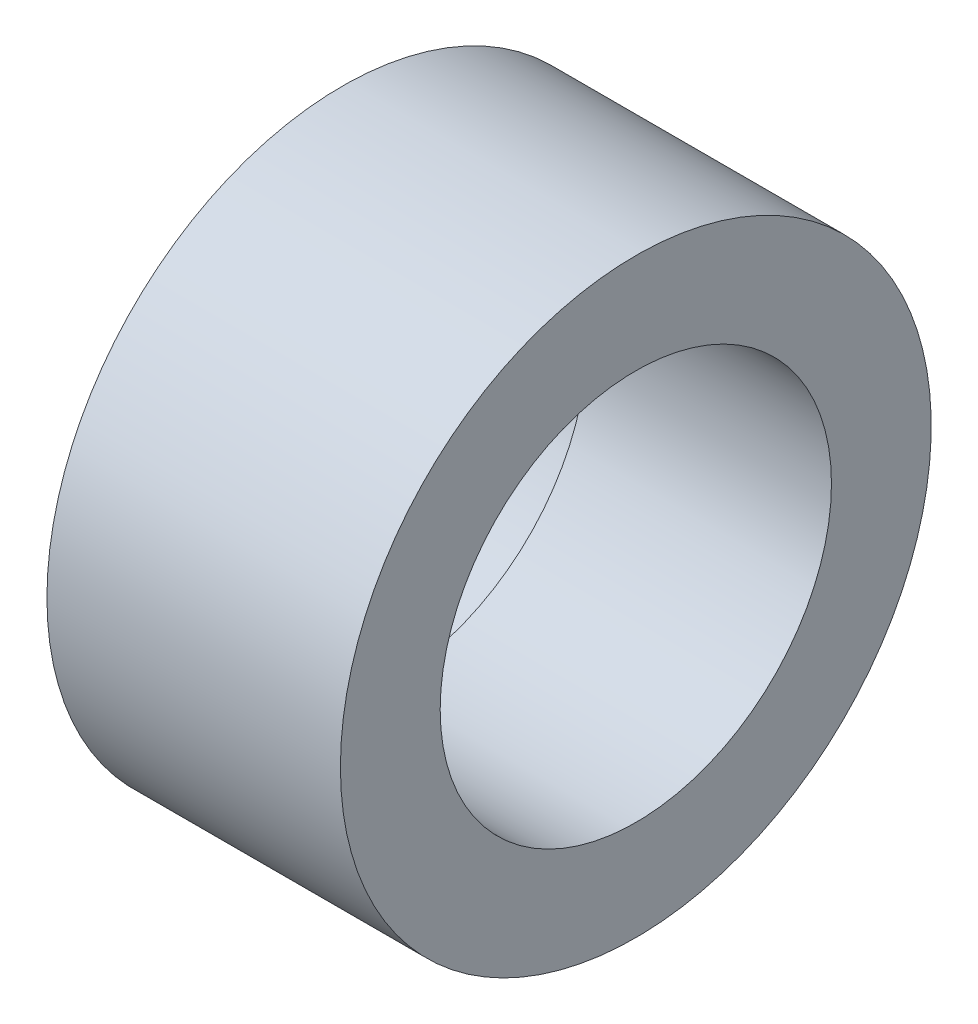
ISO-10303-21;
HEADER;
FILE_DESCRIPTION(('STEP AP214'),'2;1');
FILE_NAME('part.step','',(''),(''),'','','');
FILE_SCHEMA(('AUTOMOTIVE_DESIGN { 1 0 10303 214 1 1 1 1 }'));
ENDSEC;
DATA;
#1=APPLICATION_CONTEXT('core data for automotive mechanical design processes');
#2=APPLICATION_PROTOCOL_DEFINITION('international standard','automotive_design',2000,#1);
#3=PRODUCT_CONTEXT('',#1,'mechanical');
#4=PRODUCT('Part','Part','',(#3));
#5=PRODUCT_RELATED_PRODUCT_CATEGORY('part','',(#4));
#6=PRODUCT_DEFINITION_FORMATION('','',#4);
#7=PRODUCT_DEFINITION_CONTEXT('part definition',#1,'design');
#8=PRODUCT_DEFINITION('design','',#6,#7);
#9=PRODUCT_DEFINITION_SHAPE('','',#8);
#10=(LENGTH_UNIT() NAMED_UNIT(*) SI_UNIT(.MILLI.,.METRE.));
#11=(NAMED_UNIT(*) PLANE_ANGLE_UNIT() SI_UNIT($,.RADIAN.));
#12=(NAMED_UNIT(*) SI_UNIT($,.STERADIAN.) SOLID_ANGLE_UNIT());
#13=UNCERTAINTY_MEASURE_WITH_UNIT(LENGTH_MEASURE(1.E-05),#10,'distance_accuracy_value','');
#14=(GEOMETRIC_REPRESENTATION_CONTEXT(3) GLOBAL_UNCERTAINTY_ASSIGNED_CONTEXT((#13)) GLOBAL_UNIT_ASSIGNED_CONTEXT((#10,
#11,#12)) REPRESENTATION_CONTEXT('',''));
#15=CARTESIAN_POINT('',(0.,0.,0.));
#16=DIRECTION('',(0.,0.,1.));
#17=DIRECTION('',(1.,0.,0.));
#18=AXIS2_PLACEMENT_3D('',#15,#16,#17);
#19=CARTESIAN_POINT('',(19.05,0.,0.));
#20=DIRECTION('',(-1.,0.,0.));
#21=DIRECTION('',(0.,0.,1.));
#22=AXIS2_PLACEMENT_3D('',#19,#20,#21);
#23=CYLINDRICAL_SURFACE('',#22,12.7);
#24=CARTESIAN_POINT('',(19.05,0.,0.));
#25=DIRECTION('',(1.,0.,0.));
#26=DIRECTION('',(0.,0.,-1.));
#27=AXIS2_PLACEMENT_3D('',#24,#25,#26);
#28=CIRCLE('',#27,12.7);
#29=CARTESIAN_POINT('',(19.05,0.,12.7));
#30=VERTEX_POINT('',#29);
#31=EDGE_CURVE('E44',#30,#30,#28,.T.);
#32=CARTESIAN_POINT('',(3.175,0.,0.));
#33=DIRECTION('',(-1.,0.,0.));
#34=DIRECTION('',(0.,0.,1.));
#35=AXIS2_PLACEMENT_3D('',#32,#33,#34);
#36=CIRCLE('',#35,12.7);
#37=CARTESIAN_POINT('',(3.175,0.,12.7));
#38=VERTEX_POINT('',#37);
#39=EDGE_CURVE('E35',#38,#38,#36,.T.);
#40=CARTESIAN_POINT('',(19.05,0.,12.7));
#41=CARTESIAN_POINT('',(18.8846354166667,0.,12.7));
#42=CARTESIAN_POINT('',(18.7192708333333,0.,12.7));
#43=CARTESIAN_POINT('',(18.3885416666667,0.,12.7));
#44=CARTESIAN_POINT('',(18.2231770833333,0.,12.7));
#45=CARTESIAN_POINT('',(17.8924479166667,0.,12.7));
#46=CARTESIAN_POINT('',(17.7270833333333,0.,12.7));
#47=CARTESIAN_POINT('',(17.3963541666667,0.,12.7));
#48=CARTESIAN_POINT('',(17.2309895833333,0.,12.7));
#49=CARTESIAN_POINT('',(16.9002604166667,0.,12.7));
#50=CARTESIAN_POINT('',(16.7348958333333,0.,12.7));
#51=CARTESIAN_POINT('',(16.4041666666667,0.,12.7));
#52=CARTESIAN_POINT('',(16.2388020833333,0.,12.7));
#53=CARTESIAN_POINT('',(15.9080729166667,0.,12.7));
#54=CARTESIAN_POINT('',(15.7427083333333,0.,12.7));
#55=CARTESIAN_POINT('',(15.4119791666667,0.,12.7));
#56=CARTESIAN_POINT('',(15.2466145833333,0.,12.7));
#57=CARTESIAN_POINT('',(14.9158854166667,0.,12.7));
#58=CARTESIAN_POINT('',(14.7505208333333,0.,12.7));
#59=CARTESIAN_POINT('',(14.4197916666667,0.,12.7));
#60=CARTESIAN_POINT('',(14.2544270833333,0.,12.7));
#61=CARTESIAN_POINT('',(13.9236979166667,0.,12.7));
#62=CARTESIAN_POINT('',(13.7583333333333,0.,12.7));
#63=CARTESIAN_POINT('',(13.4276041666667,0.,12.7));
#64=CARTESIAN_POINT('',(13.2622395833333,0.,12.7));
#65=CARTESIAN_POINT('',(12.9315104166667,0.,12.7));
#66=CARTESIAN_POINT('',(12.7661458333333,0.,12.7));
#67=CARTESIAN_POINT('',(12.4354166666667,0.,12.7));
#68=CARTESIAN_POINT('',(12.2700520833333,0.,12.7));
#69=CARTESIAN_POINT('',(11.9393229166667,0.,12.7));
#70=CARTESIAN_POINT('',(11.7739583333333,0.,12.7));
#71=CARTESIAN_POINT('',(11.4432291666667,0.,12.7));
#72=CARTESIAN_POINT('',(11.2778645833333,0.,12.7));
#73=CARTESIAN_POINT('',(10.9471354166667,0.,12.7));
#74=CARTESIAN_POINT('',(10.7817708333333,0.,12.7));
#75=CARTESIAN_POINT('',(10.4510416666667,0.,12.7));
#76=CARTESIAN_POINT('',(10.2856770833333,0.,12.7));
#77=CARTESIAN_POINT('',(9.95494791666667,0.,12.7));
#78=CARTESIAN_POINT('',(9.78958333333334,0.,12.7));
#79=CARTESIAN_POINT('',(9.45885416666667,0.,12.7));
#80=CARTESIAN_POINT('',(9.29348958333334,0.,12.7));
#81=CARTESIAN_POINT('',(8.96276041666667,0.,12.7));
#82=CARTESIAN_POINT('',(8.79739583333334,0.,12.7));
#83=CARTESIAN_POINT('',(8.46666666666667,0.,12.7));
#84=CARTESIAN_POINT('',(8.30130208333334,0.,12.7));
#85=CARTESIAN_POINT('',(7.97057291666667,0.,12.7));
#86=CARTESIAN_POINT('',(7.80520833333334,0.,12.7));
#87=CARTESIAN_POINT('',(7.47447916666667,0.,12.7));
#88=CARTESIAN_POINT('',(7.30911458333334,0.,12.7));
#89=CARTESIAN_POINT('',(6.97838541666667,0.,12.7));
#90=CARTESIAN_POINT('',(6.81302083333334,0.,12.7));
#91=CARTESIAN_POINT('',(6.48229166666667,0.,12.7));
#92=CARTESIAN_POINT('',(6.31692708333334,0.,12.7));
#93=CARTESIAN_POINT('',(5.98619791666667,0.,12.7));
#94=CARTESIAN_POINT('',(5.82083333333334,0.,12.7));
#95=CARTESIAN_POINT('',(5.49010416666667,0.,12.7));
#96=CARTESIAN_POINT('',(5.32473958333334,0.,12.7));
#97=CARTESIAN_POINT('',(4.99401041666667,0.,12.7));
#98=CARTESIAN_POINT('',(4.82864583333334,0.,12.7));
#99=CARTESIAN_POINT('',(4.49791666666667,0.,12.7));
#100=CARTESIAN_POINT('',(4.33255208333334,0.,12.7));
#101=CARTESIAN_POINT('',(4.00182291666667,0.,12.7));
#102=CARTESIAN_POINT('',(3.83645833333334,0.,12.7));
#103=CARTESIAN_POINT('',(3.50572916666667,0.,12.7));
#104=CARTESIAN_POINT('',(3.34036458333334,0.,12.7));
#105=CARTESIAN_POINT('',(3.175,0.,12.7));
#106=B_SPLINE_CURVE_WITH_KNOTS('',3,(#40,#41,#42,#43,#44,#45,#46,#47,#48,#49,#50,#51,#52,#53,
#54,#55,#56,#57,#58,#59,#60,#61,#62,#63,#64,#65,#66,#67,#68,#69,#70,#71,#72,#73,#74,#75,#76,#77,
#78,#79,#80,#81,#82,#83,#84,#85,#86,#87,#88,#89,#90,#91,#92,#93,#94,#95,#96,#97,#98,#99,#100,
#101,#102,#103,#104,#105),.UNSPECIFIED.,.F.,.F.,(4,2,2,2,2,2,2,2,2,2,2,2,2,2,2,2,2,2,2,2,2,2,2,
2,2,2,2,2,2,2,2,2,4),(0.,0.496093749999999,0.992187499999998,1.48828125,1.984375,2.48046875,
2.9765625,3.47265625,3.96875,4.46484375,4.9609375,5.45703125,5.953125,6.44921875,
6.94531249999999,7.44140625,7.93749999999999,8.43359374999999,8.92968749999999,9.42578124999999,
9.92187499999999,10.41796875,10.9140625,11.41015625,11.90625,12.40234375,12.8984375,13.39453125,
13.890625,14.38671875,14.8828125,15.37890625,15.875),.UNSPECIFIED.);
#107=EDGE_CURVE('BSEAM31',#30,#38,#106,.T.);
#108=ORIENTED_EDGE('',*,*,#31,.T.);
#109=ORIENTED_EDGE('',*,*,#39,.T.);
#110=ORIENTED_EDGE('',*,*,#107,.T.);
#111=ORIENTED_EDGE('',*,*,#107,.F.);
#112=EDGE_LOOP('',(#108,#110,#109,#111));
#113=FACE_BOUND('',#112,.T.);
#114=ADVANCED_FACE('F31',(#113),#23,.F.);
#115=CARTESIAN_POINT('',(19.05,0.,0.));
#116=DIRECTION('',(1.,0.,0.));
#117=DIRECTION('',(0.,0.,-1.));
#118=AXIS2_PLACEMENT_3D('',#115,#116,#117);
#119=PLANE('',#118);
#120=CARTESIAN_POINT('',(19.05,0.,0.));
#121=DIRECTION('',(1.,0.,0.));
#122=DIRECTION('',(0.,0.,-1.));
#123=AXIS2_PLACEMENT_3D('',#120,#121,#122);
#124=CIRCLE('',#123,19.177);
#125=CARTESIAN_POINT('',(19.05,0.,19.177));
#126=VERTEX_POINT('',#125);
#127=EDGE_CURVE('E10',#126,#126,#124,.T.);
#128=ORIENTED_EDGE('',*,*,#127,.T.);
#129=EDGE_LOOP('',(#128));
#130=FACE_BOUND('',#129,.T.);
#131=ORIENTED_EDGE('',*,*,#31,.F.);
#132=EDGE_LOOP('',(#131));
#133=FACE_BOUND('',#132,.T.);
#134=ADVANCED_FACE('F69',(#130,#133),#119,.T.);
#135=CARTESIAN_POINT('',(0.,0.,0.));
#136=DIRECTION('',(1.,0.,0.));
#137=DIRECTION('',(0.,0.,-1.));
#138=AXIS2_PLACEMENT_3D('',#135,#136,#137);
#139=PLANE('',#138);
#140=CARTESIAN_POINT('',(0.,0.,0.));
#141=DIRECTION('',(-1.,0.,0.));
#142=DIRECTION('',(0.,0.,1.));
#143=AXIS2_PLACEMENT_3D('',#140,#141,#142);
#144=CIRCLE('',#143,12.827);
#145=CARTESIAN_POINT('',(0.,0.,12.827));
#146=VERTEX_POINT('',#145);
#147=EDGE_CURVE('E48',#146,#146,#144,.T.);
#148=ORIENTED_EDGE('',*,*,#147,.F.);
#149=EDGE_LOOP('',(#148));
#150=FACE_BOUND('',#149,.T.);
#151=CARTESIAN_POINT('',(0.,0.,0.));
#152=DIRECTION('',(1.,0.,0.));
#153=DIRECTION('',(0.,0.,-1.));
#154=AXIS2_PLACEMENT_3D('',#151,#152,#153);
#155=CIRCLE('',#154,19.177);
#156=CARTESIAN_POINT('',(0.,0.,19.177));
#157=VERTEX_POINT('',#156);
#158=EDGE_CURVE('E39',#157,#157,#155,.T.);
#159=ORIENTED_EDGE('',*,*,#158,.F.);
#160=EDGE_LOOP('',(#159));
#161=FACE_BOUND('',#160,.T.);
#162=ADVANCED_FACE('F77',(#150,#161),#139,.F.);
#163=CARTESIAN_POINT('',(19.05,0.,0.));
#164=DIRECTION('',(-1.,0.,0.));
#165=DIRECTION('',(0.,0.,1.));
#166=AXIS2_PLACEMENT_3D('',#163,#164,#165);
#167=CYLINDRICAL_SURFACE('',#166,19.177);
#168=CARTESIAN_POINT('',(19.05,0.,19.177));
#169=CARTESIAN_POINT('',(18.8515625,0.,19.177));
#170=CARTESIAN_POINT('',(18.653125,0.,19.177));
#171=CARTESIAN_POINT('',(18.25625,0.,19.177));
#172=CARTESIAN_POINT('',(18.0578125,0.,19.177));
#173=CARTESIAN_POINT('',(17.6609375,0.,19.177));
#174=CARTESIAN_POINT('',(17.4625,0.,19.177));
#175=CARTESIAN_POINT('',(17.065625,0.,19.177));
#176=CARTESIAN_POINT('',(16.8671875,0.,19.177));
#177=CARTESIAN_POINT('',(16.4703125,0.,19.177));
#178=CARTESIAN_POINT('',(16.271875,0.,19.177));
#179=CARTESIAN_POINT('',(15.875,0.,19.177));
#180=CARTESIAN_POINT('',(15.6765625,0.,19.177));
#181=CARTESIAN_POINT('',(15.2796875,0.,19.177));
#182=CARTESIAN_POINT('',(15.08125,0.,19.177));
#183=CARTESIAN_POINT('',(14.684375,0.,19.177));
#184=CARTESIAN_POINT('',(14.4859375,0.,19.177));
#185=CARTESIAN_POINT('',(14.0890625,0.,19.177));
#186=CARTESIAN_POINT('',(13.890625,0.,19.177));
#187=CARTESIAN_POINT('',(13.49375,0.,19.177));
#188=CARTESIAN_POINT('',(13.2953125,0.,19.177));
#189=CARTESIAN_POINT('',(12.8984375,0.,19.177));
#190=CARTESIAN_POINT('',(12.7,0.,19.177));
#191=CARTESIAN_POINT('',(12.303125,0.,19.177));
#192=CARTESIAN_POINT('',(12.1046875,0.,19.177));
#193=CARTESIAN_POINT('',(11.7078125,0.,19.177));
#194=CARTESIAN_POINT('',(11.509375,0.,19.177));
#195=CARTESIAN_POINT('',(11.1125,0.,19.177));
#196=CARTESIAN_POINT('',(10.9140625,0.,19.177));
#197=CARTESIAN_POINT('',(10.5171875,0.,19.177));
#198=CARTESIAN_POINT('',(10.31875,0.,19.177));
#199=CARTESIAN_POINT('',(9.921875,0.,19.177));
#200=CARTESIAN_POINT('',(9.7234375,0.,19.177));
#201=CARTESIAN_POINT('',(9.3265625,0.,19.177));
#202=CARTESIAN_POINT('',(9.128125,0.,19.177));
#203=CARTESIAN_POINT('',(8.73125,0.,19.177));
#204=CARTESIAN_POINT('',(8.5328125,0.,19.177));
#205=CARTESIAN_POINT('',(8.1359375,0.,19.177));
#206=CARTESIAN_POINT('',(7.9375,0.,19.177));
#207=CARTESIAN_POINT('',(7.540625,0.,19.177));
#208=CARTESIAN_POINT('',(7.3421875,0.,19.177));
#209=CARTESIAN_POINT('',(6.9453125,0.,19.177));
#210=CARTESIAN_POINT('',(6.746875,0.,19.177));
#211=CARTESIAN_POINT('',(6.35,0.,19.177));
#212=CARTESIAN_POINT('',(6.1515625,0.,19.177));
#213=CARTESIAN_POINT('',(5.7546875,0.,19.177));
#214=CARTESIAN_POINT('',(5.55625,0.,19.177));
#215=CARTESIAN_POINT('',(5.159375,0.,19.177));
#216=CARTESIAN_POINT('',(4.9609375,0.,19.177));
#217=CARTESIAN_POINT('',(4.5640625,0.,19.177));
#218=CARTESIAN_POINT('',(4.365625,0.,19.177));
#219=CARTESIAN_POINT('',(3.96875,0.,19.177));
#220=CARTESIAN_POINT('',(3.7703125,0.,19.177));
#221=CARTESIAN_POINT('',(3.3734375,0.,19.177));
#222=CARTESIAN_POINT('',(3.175,0.,19.177));
#223=CARTESIAN_POINT('',(2.778125,0.,19.177));
#224=CARTESIAN_POINT('',(2.5796875,0.,19.177));
#225=CARTESIAN_POINT('',(2.1828125,0.,19.177));
#226=CARTESIAN_POINT('',(1.984375,0.,19.177));
#227=CARTESIAN_POINT('',(1.5875,0.,19.177));
#228=CARTESIAN_POINT('',(1.3890625,0.,19.177));
#229=CARTESIAN_POINT('',(0.992187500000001,0.,19.177));
#230=CARTESIAN_POINT('',(0.793750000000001,0.,19.177));
#231=CARTESIAN_POINT('',(0.396875,0.,19.177));
#232=CARTESIAN_POINT('',(0.1984375,0.,19.177));
#233=CARTESIAN_POINT('',(0.,0.,19.177));
#234=B_SPLINE_CURVE_WITH_KNOTS('',3,(#168,#169,#170,#171,#172,#173,#174,#175,#176,#177,#178,
#179,#180,#181,#182,#183,#184,#185,#186,#187,#188,#189,#190,#191,#192,#193,#194,#195,#196,#197,
#198,#199,#200,#201,#202,#203,#204,#205,#206,#207,#208,#209,#210,#211,#212,#213,#214,#215,#216,
#217,#218,#219,#220,#221,#222,#223,#224,#225,#226,#227,#228,#229,#230,#231,#232,#233),
.UNSPECIFIED.,.F.,.F.,(4,2,2,2,2,2,2,2,2,2,2,2,2,2,2,2,2,2,2,2,2,2,2,2,2,2,2,2,2,2,2,2,4),(0.,
0.5953125,1.190625,1.7859375,2.38125,2.9765625,3.571875,4.1671875,4.7625,5.3578125,5.953125,
6.5484375,7.14375,7.7390625,8.334375,8.9296875,9.525,10.1203125,10.715625,11.3109375,11.90625,
12.5015625,13.096875,13.6921875,14.2875,14.8828125,15.478125,16.0734375,16.66875,17.2640625,
17.859375,18.4546875,19.05),.UNSPECIFIED.);
#235=EDGE_CURVE('BSEAM33',#126,#157,#234,.T.);
#236=ORIENTED_EDGE('',*,*,#127,.F.);
#237=ORIENTED_EDGE('',*,*,#158,.T.);
#238=ORIENTED_EDGE('',*,*,#235,.T.);
#239=ORIENTED_EDGE('',*,*,#235,.F.);
#240=EDGE_LOOP('',(#236,#238,#237,#239));
#241=FACE_BOUND('',#240,.T.);
#242=ADVANCED_FACE('F33',(#241),#167,.T.);
#243=CARTESIAN_POINT('',(3.175,0.,0.));
#244=DIRECTION('',(-1.,0.,0.));
#245=DIRECTION('',(0.,0.,1.));
#246=AXIS2_PLACEMENT_3D('',#243,#244,#245);
#247=CYLINDRICAL_SURFACE('',#246,12.827);
#248=CARTESIAN_POINT('',(3.175,0.,0.));
#249=DIRECTION('',(-1.,0.,0.));
#250=DIRECTION('',(0.,0.,1.));
#251=AXIS2_PLACEMENT_3D('',#248,#249,#250);
#252=CIRCLE('',#251,12.827);
#253=CARTESIAN_POINT('',(3.175,0.,12.827));
#254=VERTEX_POINT('',#253);
#255=EDGE_CURVE('E51',#254,#254,#252,.T.);
#256=ORIENTED_EDGE('',*,*,#255,.F.);
#257=EDGE_LOOP('',(#256));
#258=FACE_BOUND('',#257,.T.);
#259=ORIENTED_EDGE('',*,*,#147,.T.);
#260=EDGE_LOOP('',(#259));
#261=FACE_BOUND('',#260,.T.);
#262=ADVANCED_FACE('F61',(#258,#261),#247,.F.);
#263=CARTESIAN_POINT('',(3.175,0.,0.));
#264=DIRECTION('',(-1.,0.,0.));
#265=DIRECTION('',(0.,0.,1.));
#266=AXIS2_PLACEMENT_3D('',#263,#264,#265);
#267=PLANE('',#266);
#268=ORIENTED_EDGE('',*,*,#39,.F.);
#269=EDGE_LOOP('',(#268));
#270=FACE_BOUND('',#269,.T.);
#271=ORIENTED_EDGE('',*,*,#255,.T.);
#272=EDGE_LOOP('',(#271));
#273=FACE_BOUND('',#272,.T.);
#274=ADVANCED_FACE('F59',(#270,#273),#267,.T.);
#275=CLOSED_SHELL('',(#114,#134,#162,#242,#262,#274));
#276=MANIFOLD_SOLID_BREP('B2',#275);
#277=ADVANCED_BREP_SHAPE_REPRESENTATION('',(#18,#276),#14);
#278=SHAPE_DEFINITION_REPRESENTATION(#9,#277);
ENDSEC;
END-ISO-10303-21;
